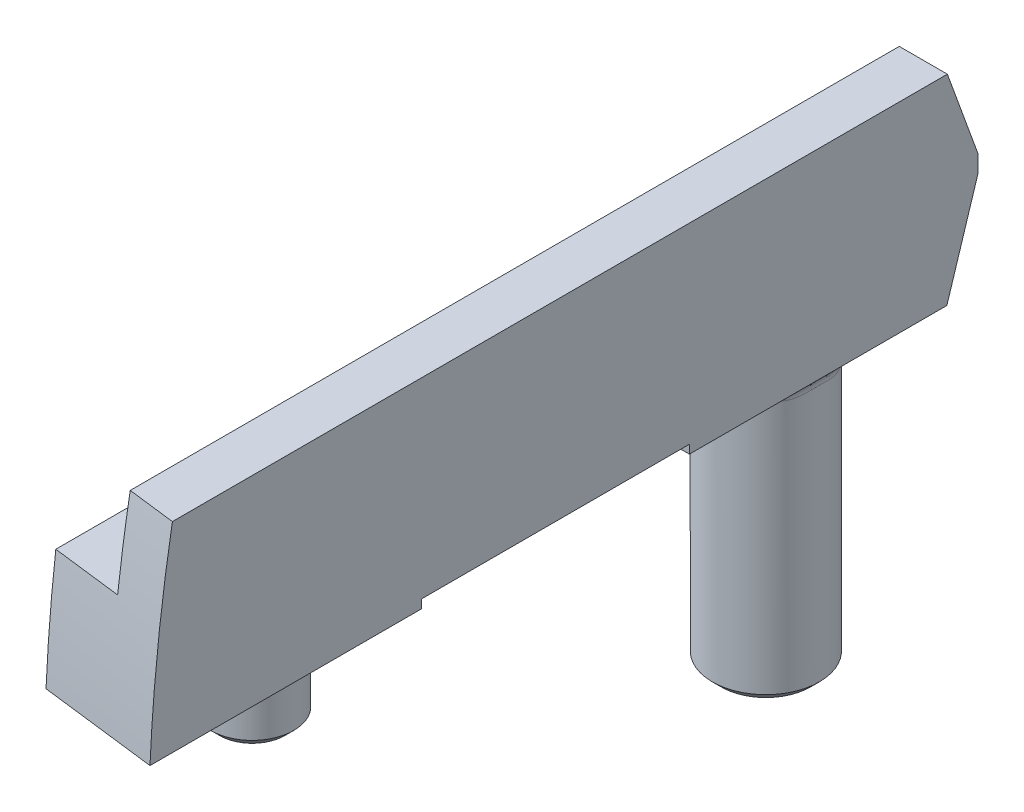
ISO-10303-21;
HEADER;
FILE_DESCRIPTION(('STEP AP214'),'2;1');
FILE_NAME('part.step','',(''),(''),'','','');
FILE_SCHEMA(('AUTOMOTIVE_DESIGN { 1 0 10303 214 1 1 1 1 }'));
ENDSEC;
DATA;
#1=APPLICATION_CONTEXT('core data for automotive mechanical design processes');
#2=APPLICATION_PROTOCOL_DEFINITION('international standard','automotive_design',2000,#1);
#3=PRODUCT_CONTEXT('',#1,'mechanical');
#4=PRODUCT('Part','Part','',(#3));
#5=PRODUCT_RELATED_PRODUCT_CATEGORY('part','',(#4));
#6=PRODUCT_DEFINITION_FORMATION('','',#4);
#7=PRODUCT_DEFINITION_CONTEXT('part definition',#1,'design');
#8=PRODUCT_DEFINITION('design','',#6,#7);
#9=PRODUCT_DEFINITION_SHAPE('','',#8);
#10=(LENGTH_UNIT() NAMED_UNIT(*) SI_UNIT(.MILLI.,.METRE.));
#11=(NAMED_UNIT(*) PLANE_ANGLE_UNIT() SI_UNIT($,.RADIAN.));
#12=(NAMED_UNIT(*) SI_UNIT($,.STERADIAN.) SOLID_ANGLE_UNIT());
#13=UNCERTAINTY_MEASURE_WITH_UNIT(LENGTH_MEASURE(1.E-05),#10,'distance_accuracy_value','');
#14=(GEOMETRIC_REPRESENTATION_CONTEXT(3) GLOBAL_UNCERTAINTY_ASSIGNED_CONTEXT((#13)) GLOBAL_UNIT_ASSIGNED_CONTEXT((#10,
#11,#12)) REPRESENTATION_CONTEXT('',''));
#15=CARTESIAN_POINT('',(0.,0.,0.));
#16=DIRECTION('',(0.,0.,1.));
#17=DIRECTION('',(1.,0.,0.));
#18=AXIS2_PLACEMENT_3D('',#15,#16,#17);
#19=CARTESIAN_POINT('',(0.,0.,24.4856));
#20=DIRECTION('',(1.,0.,0.));
#21=DIRECTION('',(0.,0.,-1.));
#22=AXIS2_PLACEMENT_3D('',#19,#20,#21);
#23=PLANE('',#22);
#24=CARTESIAN_POINT('',(0.,-2.159,-21.9443457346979));
#25=DIRECTION('',(1.,0.,0.));
#26=DIRECTION('',(0.,0.,-1.));
#27=AXIS2_PLACEMENT_3D('',#24,#25,#26);
#28=CIRCLE('',#27,46.0502);
#29=CARTESIAN_POINT('',(0.,3.429,23.765556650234));
#30=VERTEX_POINT('',#29);
#31=CARTESIAN_POINT('',(0.,0.,24.0552155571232));
#32=VERTEX_POINT('',#31);
#33=EDGE_CURVE('E155',#30,#32,#28,.T.);
#34=ORIENTED_EDGE('',*,*,#33,.F.);
#35=DIRECTION('',(0.,0.,-1.));
#36=VECTOR('',#35,1.);
#37=CARTESIAN_POINT('',(0.,3.429,24.4856));
#38=LINE('',#37,#36);
#39=CARTESIAN_POINT('',(0.,3.429,0.));
#40=VERTEX_POINT('',#39);
#41=EDGE_CURVE('E180',#30,#40,#38,.T.);
#42=ORIENTED_EDGE('',*,*,#41,.T.);
#43=DIRECTION('',(0.,-1.,0.));
#44=VECTOR('',#43,1.);
#45=CARTESIAN_POINT('',(0.,0.,0.));
#46=LINE('',#45,#44);
#47=CARTESIAN_POINT('',(0.,2.921,0.));
#48=VERTEX_POINT('',#47);
#49=EDGE_CURVE('E190',#40,#48,#46,.T.);
#50=ORIENTED_EDGE('',*,*,#49,.T.);
#51=DIRECTION('',(0.,-0.953716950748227,0.300705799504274));
#52=VECTOR('',#51,1.);
#53=CARTESIAN_POINT('',(0.,-6.75805315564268,3.05179373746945));
#54=LINE('',#53,#52);
#55=CARTESIAN_POINT('',(0.,0.,0.920987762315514));
#56=VERTEX_POINT('',#55);
#57=EDGE_CURVE('E58',#48,#56,#54,.T.);
#58=ORIENTED_EDGE('',*,*,#57,.T.);
#59=DIRECTION('',(0.,0.,-1.));
#60=VECTOR('',#59,1.);
#61=CARTESIAN_POINT('',(0.,0.,24.4856));
#62=LINE('',#61,#60);
#63=CARTESIAN_POINT('',(0.,0.,3.79883697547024));
#64=VERTEX_POINT('',#63);
#65=EDGE_CURVE('E182',#64,#56,#62,.T.);
#66=ORIENTED_EDGE('',*,*,#65,.F.);
#67=CARTESIAN_POINT('',(0.,0.,5.34516302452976));
#68=VERTEX_POINT('',#67);
#69=EDGE_CURVE('E189',#68,#64,#62,.T.);
#70=ORIENTED_EDGE('',*,*,#69,.F.);
#71=CARTESIAN_POINT('',(0.,0.,8.5344));
#72=VERTEX_POINT('',#71);
#73=EDGE_CURVE('E183',#72,#68,#62,.T.);
#74=ORIENTED_EDGE('',*,*,#73,.F.);
#75=DIRECTION('',(0.,1.,0.));
#76=VECTOR('',#75,1.);
#77=CARTESIAN_POINT('',(0.,0.,8.5344));
#78=LINE('',#77,#76);
#79=CARTESIAN_POINT('',(0.,0.254,8.5344));
#80=VERTEX_POINT('',#79);
#81=EDGE_CURVE('E387',#72,#80,#78,.T.);
#82=ORIENTED_EDGE('',*,*,#81,.T.);
#83=DIRECTION('',(0.,0.,1.));
#84=VECTOR('',#83,1.);
#85=CARTESIAN_POINT('',(0.,0.254,24.4856));
#86=LINE('',#85,#84);
#87=CARTESIAN_POINT('',(0.,0.254,16.4592));
#88=VERTEX_POINT('',#87);
#89=EDGE_CURVE('E385',#80,#88,#86,.T.);
#90=ORIENTED_EDGE('',*,*,#89,.T.);
#91=DIRECTION('',(0.,-1.,0.));
#92=VECTOR('',#91,1.);
#93=CARTESIAN_POINT('',(0.,0.,16.4592));
#94=LINE('',#93,#92);
#95=CARTESIAN_POINT('',(0.,0.,16.4592));
#96=VERTEX_POINT('',#95);
#97=EDGE_CURVE('E384',#88,#96,#94,.T.);
#98=ORIENTED_EDGE('',*,*,#97,.T.);
#99=CARTESIAN_POINT('',(0.,0.,18.7901531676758));
#100=VERTEX_POINT('',#99);
#101=EDGE_CURVE('E186',#100,#96,#62,.T.);
#102=ORIENTED_EDGE('',*,*,#101,.F.);
#103=CARTESIAN_POINT('',(0.,0.,20.0718468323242));
#104=VERTEX_POINT('',#103);
#105=EDGE_CURVE('E179',#104,#100,#62,.T.);
#106=ORIENTED_EDGE('',*,*,#105,.F.);
#107=EDGE_CURVE('E168',#32,#104,#62,.T.);
#108=ORIENTED_EDGE('',*,*,#107,.F.);
#109=EDGE_LOOP('',(#34,#42,#50,#58,#66,#70,#74,#82,#90,#98,#102,#106,#108));
#110=FACE_BOUND('',#109,.T.);
#111=ADVANCED_FACE('F36',(#110),#23,.F.);
#112=CARTESIAN_POINT('',(3.5052,0.,24.4856));
#113=DIRECTION('',(0.,1.,0.));
#114=DIRECTION('',(-1.,0.,0.));
#115=AXIS2_PLACEMENT_3D('',#112,#113,#114);
#116=PLANE('',#115);
#117=ORIENTED_EDGE('',*,*,#73,.T.);
#118=CARTESIAN_POINT('',(1.8034,0.,4.572));
#119=DIRECTION('',(0.,1.,0.));
#120=DIRECTION('',(-1.,0.,0.));
#121=AXIS2_PLACEMENT_3D('',#118,#119,#120);
#122=CIRCLE('',#121,1.96215);
#123=CARTESIAN_POINT('',(3.5052,0.,5.54868284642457));
#124=VERTEX_POINT('',#123);
#125=EDGE_CURVE('E272',#68,#124,#122,.T.);
#126=ORIENTED_EDGE('',*,*,#125,.T.);
#127=DIRECTION('',(0.,0.,-1.));
#128=VECTOR('',#127,1.);
#129=CARTESIAN_POINT('',(3.5052,0.,24.4856));
#130=LINE('',#129,#128);
#131=CARTESIAN_POINT('',(3.5052,0.,8.5344));
#132=VERTEX_POINT('',#131);
#133=EDGE_CURVE('E389',#132,#124,#130,.T.);
#134=ORIENTED_EDGE('',*,*,#133,.F.);
#135=DIRECTION('',(-1.,0.,0.));
#136=VECTOR('',#135,1.);
#137=CARTESIAN_POINT('',(12.2428,0.,8.5344));
#138=LINE('',#137,#136);
#139=EDGE_CURVE('E361',#132,#72,#138,.T.);
#140=ORIENTED_EDGE('',*,*,#139,.T.);
#141=EDGE_LOOP('',(#117,#126,#134,#140));
#142=FACE_BOUND('',#141,.T.);
#143=ADVANCED_FACE('F250',(#142),#116,.F.);
#144=CARTESIAN_POINT('',(3.5052,0.,24.4856));
#145=VERTEX_POINT('',#144);
#146=CARTESIAN_POINT('',(3.5052,0.,16.4592));
#147=VERTEX_POINT('',#146);
#148=EDGE_CURVE('E172',#145,#147,#130,.T.);
#149=ORIENTED_EDGE('',*,*,#148,.F.);
#150=DIRECTION('',(-0.992546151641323,0.,-0.121869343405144));
#151=VECTOR('',#150,1.);
#152=CARTESIAN_POINT('',(3.5052,0.,24.4856));
#153=LINE('',#152,#151);
#154=EDGE_CURVE('E158',#145,#32,#153,.T.);
#155=ORIENTED_EDGE('',*,*,#154,.T.);
#156=ORIENTED_EDGE('',*,*,#107,.T.);
#157=CARTESIAN_POINT('',(1.4732,0.,19.431));
#158=DIRECTION('',(0.,1.,0.));
#159=DIRECTION('',(-1.,0.,0.));
#160=AXIS2_PLACEMENT_3D('',#157,#158,#159);
#161=CIRCLE('',#160,1.60655);
#162=EDGE_CURVE('E415',#104,#100,#161,.T.);
#163=ORIENTED_EDGE('',*,*,#162,.T.);
#164=ORIENTED_EDGE('',*,*,#101,.T.);
#165=DIRECTION('',(-1.,0.,0.));
#166=VECTOR('',#165,1.);
#167=CARTESIAN_POINT('',(12.2428,0.,16.4592));
#168=LINE('',#167,#166);
#169=EDGE_CURVE('E268',#147,#96,#168,.T.);
#170=ORIENTED_EDGE('',*,*,#169,.F.);
#171=EDGE_LOOP('',(#149,#155,#156,#163,#164,#170));
#172=FACE_BOUND('',#171,.T.);
#173=ADVANCED_FACE('F167',(#172),#116,.F.);
#174=ORIENTED_EDGE('',*,*,#65,.T.);
#175=DIRECTION('',(-1.,0.,0.));
#176=VECTOR('',#175,1.);
#177=CARTESIAN_POINT('',(12.2428,0.,0.920987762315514));
#178=LINE('',#177,#176);
#179=CARTESIAN_POINT('',(3.5052,0.,0.920987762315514));
#180=VERTEX_POINT('',#179);
#181=EDGE_CURVE('E623',#180,#56,#178,.T.);
#182=ORIENTED_EDGE('',*,*,#181,.F.);
#183=CARTESIAN_POINT('',(3.5052,0.,3.59531715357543));
#184=VERTEX_POINT('',#183);
#185=EDGE_CURVE('E329',#184,#180,#130,.T.);
#186=ORIENTED_EDGE('',*,*,#185,.F.);
#187=CARTESIAN_POINT('',(1.8034,0.,4.572));
#188=DIRECTION('',(0.,1.,0.));
#189=DIRECTION('',(-1.,0.,0.));
#190=AXIS2_PLACEMENT_3D('',#187,#188,#189);
#191=CIRCLE('',#190,1.96215);
#192=EDGE_CURVE('E210',#184,#64,#191,.T.);
#193=ORIENTED_EDGE('',*,*,#192,.T.);
#194=EDGE_LOOP('',(#174,#182,#186,#193));
#195=FACE_BOUND('',#194,.T.);
#196=ADVANCED_FACE('F518',(#195),#116,.F.);
#197=CARTESIAN_POINT('',(3.5052,5.9182,24.4856));
#198=DIRECTION('',(-1.,0.,0.));
#199=DIRECTION('',(0.,-1.,0.));
#200=AXIS2_PLACEMENT_3D('',#197,#198,#199);
#201=PLANE('',#200);
#202=DIRECTION('',(0.,0.,-1.));
#203=VECTOR('',#202,1.);
#204=CARTESIAN_POINT('',(3.5052,5.9182,24.4856));
#205=LINE('',#204,#203);
#206=CARTESIAN_POINT('',(3.5052,5.91820000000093,23.822334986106));
#207=VERTEX_POINT('',#206);
#208=CARTESIAN_POINT('',(3.5052,5.9182,0.905994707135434));
#209=VERTEX_POINT('',#208);
#210=EDGE_CURVE('E626',#207,#209,#205,.T.);
#211=ORIENTED_EDGE('',*,*,#210,.F.);
#212=CARTESIAN_POINT('',(3.5052,6.91864725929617,23.6326580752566));
#213=CARTESIAN_POINT('',(3.5052,6.69030712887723,23.6785706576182));
#214=CARTESIAN_POINT('',(3.5052,6.46161862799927,23.7227506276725));
#215=CARTESIAN_POINT('',(3.5052,6.00380772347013,23.8075968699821));
#216=CARTESIAN_POINT('',(3.5052,5.77468591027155,23.8482663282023));
#217=CARTESIAN_POINT('',(3.5052,5.31600988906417,23.9261005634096));
#218=CARTESIAN_POINT('',(3.5052,5.08645608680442,23.9632677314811));
#219=CARTESIAN_POINT('',(3.5052,4.62691722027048,24.034104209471));
#220=CARTESIAN_POINT('',(3.5052,4.39693240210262,24.0677751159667));
#221=CARTESIAN_POINT('',(3.5052,3.93653221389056,24.1316234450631));
#222=CARTESIAN_POINT('',(3.5052,3.70611695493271,24.1618016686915));
#223=CARTESIAN_POINT('',(3.5052,3.24485600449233,24.2186666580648));
#224=CARTESIAN_POINT('',(3.5052,3.01401031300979,24.2453534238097));
#225=CARTESIAN_POINT('',(3.5052,2.55188829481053,24.2952351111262));
#226=CARTESIAN_POINT('',(3.5052,2.3206118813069,24.3184292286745));
#227=CARTESIAN_POINT('',(3.5052,1.8576281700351,24.3613228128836));
#228=CARTESIAN_POINT('',(3.5052,1.6259207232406,24.381020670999));
#229=CARTESIAN_POINT('',(3.5052,1.16207446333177,24.4169164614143));
#230=CARTESIAN_POINT('',(3.5052,0.929935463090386,24.4331119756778));
#231=CARTESIAN_POINT('',(3.5052,0.465225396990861,24.4619955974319));
#232=CARTESIAN_POINT('',(3.5052,0.232654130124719,24.4746804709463));
#233=CARTESIAN_POINT('',(3.5052,0.,24.4856));
#234=B_SPLINE_CURVE_WITH_KNOTS('',3,(#212,#213,#214,#215,#216,#217,#218,#219,#220,#221,#222,
#223,#224,#225,#226,#227,#228,#229,#230,#231,#232,#233),.UNSPECIFIED.,.F.,.F.,(4,2,2,2,2,2,2,2,
2,2,4),(0.,0.698724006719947,1.39680706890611,2.09441002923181,2.79169301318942,
3.48881576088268,4.18593850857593,4.88322149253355,5.58082445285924,6.2789075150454,
6.97763152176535),.UNSPECIFIED.);
#235=EDGE_CURVE('E163',#207,#145,#234,.T.);
#236=ORIENTED_EDGE('',*,*,#235,.T.);
#237=ORIENTED_EDGE('',*,*,#148,.T.);
#238=DIRECTION('',(0.,1.,0.));
#239=VECTOR('',#238,1.);
#240=CARTESIAN_POINT('',(3.5052,5.9182,16.4592));
#241=LINE('',#240,#239);
#242=CARTESIAN_POINT('',(3.5052,0.254,16.4592));
#243=VERTEX_POINT('',#242);
#244=EDGE_CURVE('E363',#147,#243,#241,.T.);
#245=ORIENTED_EDGE('',*,*,#244,.T.);
#246=DIRECTION('',(0.,0.,-1.));
#247=VECTOR('',#246,1.);
#248=CARTESIAN_POINT('',(3.5052,0.254,24.4856));
#249=LINE('',#248,#247);
#250=CARTESIAN_POINT('',(3.5052,0.254,8.5344));
#251=VERTEX_POINT('',#250);
#252=EDGE_CURVE('E340',#243,#251,#249,.T.);
#253=ORIENTED_EDGE('',*,*,#252,.T.);
#254=DIRECTION('',(0.,-1.,0.));
#255=VECTOR('',#254,1.);
#256=CARTESIAN_POINT('',(3.5052,5.9182,8.5344));
#257=LINE('',#256,#255);
#258=EDGE_CURVE('E335',#251,#132,#257,.T.);
#259=ORIENTED_EDGE('',*,*,#258,.T.);
#260=ORIENTED_EDGE('',*,*,#133,.T.);
#261=EDGE_CURVE('E625',#124,#184,#130,.T.);
#262=ORIENTED_EDGE('',*,*,#261,.T.);
#263=ORIENTED_EDGE('',*,*,#185,.T.);
#264=DIRECTION('',(0.,0.953716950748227,-0.300705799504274));
#265=VECTOR('',#264,1.);
#266=CARTESIAN_POINT('',(3.5052,-1.37500034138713,1.35452370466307));
#267=LINE('',#266,#265);
#268=CARTESIAN_POINT('',(3.5052,2.921,0.));
#269=VERTEX_POINT('',#268);
#270=EDGE_CURVE('E315',#180,#269,#267,.T.);
#271=ORIENTED_EDGE('',*,*,#270,.T.);
#272=DIRECTION('',(0.,1.,0.));
#273=VECTOR('',#272,1.);
#274=CARTESIAN_POINT('',(3.5052,5.9182,0.));
#275=LINE('',#274,#273);
#276=CARTESIAN_POINT('',(3.5052,3.429,0.));
#277=VERTEX_POINT('',#276);
#278=EDGE_CURVE('E326',#269,#277,#275,.T.);
#279=ORIENTED_EDGE('',*,*,#278,.T.);
#280=DIRECTION('',(0.,0.939692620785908,0.34202014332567));
#281=VECTOR('',#280,1.);
#282=CARTESIAN_POINT('',(3.5052,13.4965390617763,3.66428455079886));
#283=LINE('',#282,#281);
#284=EDGE_CURVE('E174',#277,#209,#283,.T.);
#285=ORIENTED_EDGE('',*,*,#284,.T.);
#286=EDGE_LOOP('',(#211,#236,#237,#245,#253,#259,#260,#262,#263,#271,#279,#285));
#287=FACE_BOUND('',#286,.T.);
#288=ADVANCED_FACE('F324',(#287),#201,.F.);
#289=CARTESIAN_POINT('',(2.0828,5.9182,24.4856));
#290=DIRECTION('',(0.,-1.,0.));
#291=DIRECTION('',(1.,0.,0.));
#292=AXIS2_PLACEMENT_3D('',#289,#290,#291);
#293=PLANE('',#292);
#294=DIRECTION('',(0.,0.,-1.));
#295=VECTOR('',#294,1.);
#296=CARTESIAN_POINT('',(2.0828,5.9182,24.4856));
#297=LINE('',#296,#295);
#298=CARTESIAN_POINT('',(2.0828,5.91819999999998,23.647686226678));
#299=VERTEX_POINT('',#298);
#300=CARTESIAN_POINT('',(2.0828,5.9182,0.905994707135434));
#301=VERTEX_POINT('',#300);
#302=EDGE_CURVE('E347',#299,#301,#297,.T.);
#303=ORIENTED_EDGE('',*,*,#302,.F.);
#304=DIRECTION('',(-0.992546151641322,0.,-0.121869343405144));
#305=VECTOR('',#304,1.);
#306=CARTESIAN_POINT('',(1.7526,5.9182,23.6071427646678));
#307=LINE('',#306,#305);
#308=EDGE_CURVE('E618',#299,#207,#307,.F.);
#309=ORIENTED_EDGE('',*,*,#308,.T.);
#310=ORIENTED_EDGE('',*,*,#210,.T.);
#311=DIRECTION('',(-1.,0.,0.));
#312=VECTOR('',#311,1.);
#313=CARTESIAN_POINT('',(12.2428,5.9182,0.905994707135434));
#314=LINE('',#313,#312);
#315=EDGE_CURVE('E330',#209,#301,#314,.T.);
#316=ORIENTED_EDGE('',*,*,#315,.T.);
#317=EDGE_LOOP('',(#303,#309,#310,#316));
#318=FACE_BOUND('',#317,.T.);
#319=ADVANCED_FACE('F573',(#318),#293,.F.);
#320=CARTESIAN_POINT('',(2.0828,3.429,24.4856));
#321=DIRECTION('',(1.,0.,0.));
#322=DIRECTION('',(0.,0.,-1.));
#323=AXIS2_PLACEMENT_3D('',#320,#321,#322);
#324=PLANE('',#323);
#325=DIRECTION('',(0.,0.,-1.));
#326=VECTOR('',#325,1.);
#327=CARTESIAN_POINT('',(2.0828,3.429,24.4856));
#328=LINE('',#327,#326);
#329=CARTESIAN_POINT('',(2.0828,3.429,24.0212923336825));
#330=VERTEX_POINT('',#329);
#331=CARTESIAN_POINT('',(2.0828,3.429,0.));
#332=VERTEX_POINT('',#331);
#333=EDGE_CURVE('E184',#330,#332,#328,.T.);
#334=ORIENTED_EDGE('',*,*,#333,.F.);
#335=CARTESIAN_POINT('',(2.0828,3.429,24.0212923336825));
#336=CARTESIAN_POINT('',(2.0828,3.84556874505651,23.9703649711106));
#337=CARTESIAN_POINT('',(2.0828,4.2612864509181,23.9137674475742));
#338=CARTESIAN_POINT('',(2.0828,5.09101978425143,23.7892320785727));
#339=CARTESIAN_POINT('',(2.0828,5.50503541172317,23.7212942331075));
#340=CARTESIAN_POINT('',(2.0828,5.91819999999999,23.6476862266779));
#341=B_SPLINE_CURVE_WITH_KNOTS('',3,(#335,#336,#337,#338,#339,#340),.UNSPECIFIED.,.F.,.F.,(4,2,
4),(0.,1.25865818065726,2.51731636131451),.UNSPECIFIED.);
#342=EDGE_CURVE('E51',#330,#299,#341,.T.);
#343=ORIENTED_EDGE('',*,*,#342,.T.);
#344=ORIENTED_EDGE('',*,*,#302,.T.);
#345=DIRECTION('',(0.,-0.939692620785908,-0.34202014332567));
#346=VECTOR('',#345,1.);
#347=CARTESIAN_POINT('',(2.0828,11.2985201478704,2.86427109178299));
#348=LINE('',#347,#346);
#349=EDGE_CURVE('E353',#301,#332,#348,.T.);
#350=ORIENTED_EDGE('',*,*,#349,.T.);
#351=EDGE_LOOP('',(#334,#343,#344,#350));
#352=FACE_BOUND('',#351,.T.);
#353=ADVANCED_FACE('F355',(#352),#324,.F.);
#354=CARTESIAN_POINT('',(0.,3.429,24.4856));
#355=DIRECTION('',(0.,-1.,0.));
#356=DIRECTION('',(0.,0.,-1.));
#357=AXIS2_PLACEMENT_3D('',#354,#355,#356);
#358=PLANE('',#357);
#359=ORIENTED_EDGE('',*,*,#41,.F.);
#360=DIRECTION('',(-0.992546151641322,0.,-0.121869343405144));
#361=VECTOR('',#360,1.);
#362=CARTESIAN_POINT('',(1.7526,3.429,23.9807488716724));
#363=LINE('',#362,#361);
#364=EDGE_CURVE('E11',#30,#330,#363,.F.);
#365=ORIENTED_EDGE('',*,*,#364,.T.);
#366=ORIENTED_EDGE('',*,*,#333,.T.);
#367=DIRECTION('',(-1.,0.,0.));
#368=VECTOR('',#367,1.);
#369=CARTESIAN_POINT('',(0.,3.429,0.));
#370=LINE('',#369,#368);
#371=EDGE_CURVE('E334',#332,#40,#370,.T.);
#372=ORIENTED_EDGE('',*,*,#371,.T.);
#373=EDGE_LOOP('',(#359,#365,#366,#372));
#374=FACE_BOUND('',#373,.T.);
#375=ADVANCED_FACE('F253',(#374),#358,.F.);
#376=CARTESIAN_POINT('',(0.,0.,0.));
#377=DIRECTION('',(0.,0.,-1.));
#378=DIRECTION('',(-1.,0.,0.));
#379=AXIS2_PLACEMENT_3D('',#376,#377,#378);
#380=PLANE('',#379);
#381=DIRECTION('',(1.,0.,0.));
#382=VECTOR('',#381,1.);
#383=CARTESIAN_POINT('',(0.,2.921,0.));
#384=LINE('',#383,#382);
#385=EDGE_CURVE('E44',#48,#269,#384,.T.);
#386=ORIENTED_EDGE('',*,*,#385,.F.);
#387=ORIENTED_EDGE('',*,*,#49,.F.);
#388=ORIENTED_EDGE('',*,*,#371,.F.);
#389=DIRECTION('',(-1.,0.,0.));
#390=VECTOR('',#389,1.);
#391=CARTESIAN_POINT('',(0.,3.429,0.));
#392=LINE('',#391,#390);
#393=EDGE_CURVE('E274',#277,#332,#392,.T.);
#394=ORIENTED_EDGE('',*,*,#393,.F.);
#395=ORIENTED_EDGE('',*,*,#278,.F.);
#396=EDGE_LOOP('',(#386,#387,#388,#394,#395));
#397=FACE_BOUND('',#396,.T.);
#398=ADVANCED_FACE('F251',(#397),#380,.T.);
#399=CARTESIAN_POINT('',(12.2428,0.,8.5344));
#400=DIRECTION('',(0.,0.,-1.));
#401=DIRECTION('',(-1.,0.,0.));
#402=AXIS2_PLACEMENT_3D('',#399,#400,#401);
#403=PLANE('',#402);
#404=DIRECTION('',(-1.,0.,0.));
#405=VECTOR('',#404,1.);
#406=CARTESIAN_POINT('',(12.2428,0.254,8.5344));
#407=LINE('',#406,#405);
#408=EDGE_CURVE('E364',#251,#80,#407,.T.);
#409=ORIENTED_EDGE('',*,*,#408,.T.);
#410=ORIENTED_EDGE('',*,*,#81,.F.);
#411=ORIENTED_EDGE('',*,*,#139,.F.);
#412=ORIENTED_EDGE('',*,*,#258,.F.);
#413=EDGE_LOOP('',(#409,#410,#411,#412));
#414=FACE_BOUND('',#413,.T.);
#415=ADVANCED_FACE('F534',(#414),#403,.F.);
#416=CARTESIAN_POINT('',(12.2428,0.254,8.5344));
#417=DIRECTION('',(0.,1.,0.));
#418=DIRECTION('',(0.,0.,1.));
#419=AXIS2_PLACEMENT_3D('',#416,#417,#418);
#420=PLANE('',#419);
#421=DIRECTION('',(-1.,0.,0.));
#422=VECTOR('',#421,1.);
#423=CARTESIAN_POINT('',(12.2428,0.254,16.4592));
#424=LINE('',#423,#422);
#425=EDGE_CURVE('E367',#243,#88,#424,.T.);
#426=ORIENTED_EDGE('',*,*,#425,.T.);
#427=ORIENTED_EDGE('',*,*,#89,.F.);
#428=ORIENTED_EDGE('',*,*,#408,.F.);
#429=ORIENTED_EDGE('',*,*,#252,.F.);
#430=EDGE_LOOP('',(#426,#427,#428,#429));
#431=FACE_BOUND('',#430,.T.);
#432=ADVANCED_FACE('F379',(#431),#420,.F.);
#433=CARTESIAN_POINT('',(12.2428,0.254,16.4592));
#434=DIRECTION('',(0.,0.,1.));
#435=DIRECTION('',(1.,0.,0.));
#436=AXIS2_PLACEMENT_3D('',#433,#434,#435);
#437=PLANE('',#436);
#438=ORIENTED_EDGE('',*,*,#169,.T.);
#439=ORIENTED_EDGE('',*,*,#97,.F.);
#440=ORIENTED_EDGE('',*,*,#425,.F.);
#441=ORIENTED_EDGE('',*,*,#244,.F.);
#442=EDGE_LOOP('',(#438,#439,#440,#441));
#443=FACE_BOUND('',#442,.T.);
#444=ADVANCED_FACE('F382',(#443),#437,.F.);
#445=CARTESIAN_POINT('',(1.8034,-8.128,4.572));
#446=DIRECTION('',(0.,1.,0.));
#447=DIRECTION('',(-1.,0.,0.));
#448=AXIS2_PLACEMENT_3D('',#445,#446,#447);
#449=CYLINDRICAL_SURFACE('',#448,1.58115);
#450=CARTESIAN_POINT('',(1.8034,-0.380999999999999,4.572));
#451=DIRECTION('',(0.,1.,0.));
#452=DIRECTION('',(-1.,0.,0.));
#453=AXIS2_PLACEMENT_3D('',#450,#451,#452);
#454=CIRCLE('',#453,1.58115);
#455=CARTESIAN_POINT('',(3.17475339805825,-0.381,5.35903569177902));
#456=VERTEX_POINT('',#455);
#457=CARTESIAN_POINT('',(0.350174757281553,-0.380999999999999,5.19503428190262));
#458=VERTEX_POINT('',#457);
#459=EDGE_CURVE('E634',#456,#458,#454,.F.);
#460=ORIENTED_EDGE('',*,*,#459,.T.);
#461=CARTESIAN_POINT('',(0.485669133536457,-0.341889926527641,5.44585392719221));
#462=CARTESIAN_POINT('',(0.404431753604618,0.198902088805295,5.32335175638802));
#463=CARTESIAN_POINT('',(0.,0.,5.65642113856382));
#464=CARTESIAN_POINT('',(0.473872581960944,-0.349068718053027,5.42807390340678));
#465=CARTESIAN_POINT('',(0.406640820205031,0.178880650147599,5.32321057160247));
#466=CARTESIAN_POINT('',(0.,0.,5.6343567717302));
#467=CARTESIAN_POINT('',(0.462311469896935,-0.354981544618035,5.40985016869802));
#468=CARTESIAN_POINT('',(0.406379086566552,0.159315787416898,5.31997305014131));
#469=CARTESIAN_POINT('',(0.,0.,5.61174177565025));
#470=CARTESIAN_POINT('',(0.439820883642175,-0.364699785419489,5.37272062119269));
#471=CARTESIAN_POINT('',(0.402321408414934,0.122770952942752,5.30847350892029));
#472=CARTESIAN_POINT('',(0.,0.,5.56566534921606));
#473=CARTESIAN_POINT('',(0.428889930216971,-0.368510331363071,5.35381659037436));
#474=CARTESIAN_POINT('',(0.398666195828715,0.105645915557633,5.30040545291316));
#475=CARTESIAN_POINT('',(0.,0.,5.54220613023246));
#476=CARTESIAN_POINT('',(0.397371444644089,-0.377414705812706,5.29657318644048));
#477=CARTESIAN_POINT('',(0.384935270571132,0.0596171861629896,5.27120052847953));
#478=CARTESIAN_POINT('',(0.,0.,5.47116913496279));
#479=CARTESIAN_POINT('',(0.377859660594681,-0.38008491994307,5.25740417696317));
#480=CARTESIAN_POINT('',(0.37193086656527,0.0333213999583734,5.2445833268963));
#481=CARTESIAN_POINT('',(0.,0.,5.42256180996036));
#482=CARTESIAN_POINT('',(0.327010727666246,-0.382134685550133,5.14370656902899));
#483=CARTESIAN_POINT('',(0.3339106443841,-0.0259479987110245,5.15838758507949));
#484=CARTESIAN_POINT('',(0.,0.,5.28146718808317));
#485=CARTESIAN_POINT('',(0.2996909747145,-0.376798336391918,5.06738053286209));
#486=CARTESIAN_POINT('',(0.306120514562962,-0.0514829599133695,5.08692385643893));
#487=CARTESIAN_POINT('',(0.,0.,5.1867493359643));
#488=CARTESIAN_POINT('',(0.25695966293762,-0.364041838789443,4.91132322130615));
#489=CARTESIAN_POINT('',(0.261933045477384,-0.0840141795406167,4.93322582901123));
#490=CARTESIAN_POINT('',(0.,0.,4.99308785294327));
#491=CARTESIAN_POINT('',(0.241598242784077,-0.356613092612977,4.8315790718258));
#492=CARTESIAN_POINT('',(0.244256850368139,-0.0924685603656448,4.84910813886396));
#493=CARTESIAN_POINT('',(0.,0.,4.8941282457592));
#494=CARTESIAN_POINT('',(0.227566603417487,-0.349350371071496,4.7084593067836));
#495=CARTESIAN_POINT('',(0.228332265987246,-0.0994879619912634,4.71818961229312));
#496=CARTESIAN_POINT('',(0.,0.,4.74134106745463));
#497=CARTESIAN_POINT('',(0.224442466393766,-0.347587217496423,4.6656473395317));
#498=CARTESIAN_POINT('',(0.224748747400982,-0.100889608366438,4.67230117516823));
#499=CARTESIAN_POINT('',(0.,0.,4.68821296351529));
#500=CARTESIAN_POINT('',(0.221687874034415,-0.346039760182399,4.57988390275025));
#501=CARTESIAN_POINT('',(0.221616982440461,-0.102122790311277,4.58054792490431));
#502=CARTESIAN_POINT('',(0.,0.,4.58178363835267));
#503=CARTESIAN_POINT('',(0.222057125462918,-0.346255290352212,4.53693244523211));
#504=CARTESIAN_POINT('',(0.222040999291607,-0.101965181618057,4.53428488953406));
#505=CARTESIAN_POINT('',(0.,0.,4.52848243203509));
#506=CARTESIAN_POINT('',(0.226285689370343,-0.34861390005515,4.45121666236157));
#507=CARTESIAN_POINT('',(0.22685324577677,-0.100052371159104,4.44270463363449));
#508=CARTESIAN_POINT('',(0.,0.,4.42211224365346));
#509=CARTESIAN_POINT('',(0.230146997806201,-0.350758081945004,4.40845245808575));
#510=CARTESIAN_POINT('',(0.231285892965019,-0.0982793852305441,4.39699178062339));
#511=CARTESIAN_POINT('',(0.,0.,4.36904341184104));
#512=CARTESIAN_POINT('',(0.241321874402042,-0.356327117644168,4.3234310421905));
#513=CARTESIAN_POINT('',(0.243793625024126,-0.0924811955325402,4.30746215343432));
#514=CARTESIAN_POINT('',(0.,0.,4.26353490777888));
#515=CARTESIAN_POINT('',(0.248636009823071,-0.359752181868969,4.28117391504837));
#516=CARTESIAN_POINT('',(0.251977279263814,-0.0883974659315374,4.26327492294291));
#517=CARTESIAN_POINT('',(0.,0.,4.21109534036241));
#518=CARTESIAN_POINT('',(0.266473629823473,-0.36674703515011,4.19830155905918));
#519=CARTESIAN_POINT('',(0.271194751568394,-0.0769387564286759,4.17874710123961));
#520=CARTESIAN_POINT('',(0.,0.,4.10825374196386));
#521=CARTESIAN_POINT('',(0.276925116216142,-0.370312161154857,4.15767054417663));
#522=CARTESIAN_POINT('',(0.282322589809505,-0.0695051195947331,4.13801968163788));
#523=CARTESIAN_POINT('',(0.,0.,4.05783212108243));
#524=CARTESIAN_POINT('',(0.301026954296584,-0.376396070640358,4.07736217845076));
#525=CARTESIAN_POINT('',(0.306565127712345,-0.0498795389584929,4.06062910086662));
#526=CARTESIAN_POINT('',(0.,0.,3.9581723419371));
#527=CARTESIAN_POINT('',(0.314673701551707,-0.378916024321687,4.03768380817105));
#528=CARTESIAN_POINT('',(0.319857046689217,-0.0374407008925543,4.02374191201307));
#529=CARTESIAN_POINT('',(0.,0.,3.90893291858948));
#530=CARTESIAN_POINT('',(0.345129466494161,-0.381420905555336,3.95942868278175));
#531=CARTESIAN_POINT('',(0.346774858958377,-0.00594020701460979,3.95585191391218));
#532=CARTESIAN_POINT('',(0.,0.,3.81182113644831));
#533=CARTESIAN_POINT('',(0.361941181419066,-0.381403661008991,3.9208528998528));
#534=CARTESIAN_POINT('',(0.360547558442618,0.0135875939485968,3.92479655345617));
#535=CARTESIAN_POINT('',(0.,0.,3.76394998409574));
#536=CARTESIAN_POINT('',(0.389409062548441,-0.378048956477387,3.86410921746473));
#537=CARTESIAN_POINT('',(0.378708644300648,0.0487141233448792,3.88565600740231));
#538=CARTESIAN_POINT('',(0.,0.,3.69353312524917));
#539=CARTESIAN_POINT('',(0.39896260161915,-0.376368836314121,3.84534295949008));
#540=CARTESIAN_POINT('',(0.384475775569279,0.0618178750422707,3.87360300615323));
#541=CARTESIAN_POINT('',(0.,0.,3.67024487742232));
#542=CARTESIAN_POINT('',(0.418767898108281,-0.371578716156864,3.80827701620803));
#543=CARTESIAN_POINT('',(0.394502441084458,0.0903262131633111,3.85249891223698));
#544=CARTESIAN_POINT('',(0.,0.,3.62424738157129));
#545=CARTESIAN_POINT('',(0.429020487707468,-0.368466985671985,3.78997792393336));
#546=CARTESIAN_POINT('',(0.398721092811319,0.105846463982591,3.84352783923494));
#547=CARTESIAN_POINT('',(0.,0.,3.60153886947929));
#548=CARTESIAN_POINT('',(0.439588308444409,-0.364484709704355,3.77196688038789));
#549=CARTESIAN_POINT('',(0.401651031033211,0.122273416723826,3.83663833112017));
#550=CARTESIAN_POINT('',(0.,0.,3.57918781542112));
#551=(BOUNDED_SURFACE() B_SPLINE_SURFACE(3,2,((#461,#462,#463),(#464,#465,#466),(#467,#468,
#469),(#470,#471,#472),(#473,#474,#475),(#476,#477,#478),(#479,#480,#481),(#482,#483,#484),
(#485,#486,#487),(#488,#489,#490),(#491,#492,#493),(#494,#495,#496),(#497,#498,#499),(#500,#501,
#502),(#503,#504,#505),(#506,#507,#508),(#509,#510,#511),(#512,#513,#514),(#515,#516,#517),
(#518,#519,#520),(#521,#522,#523),(#524,#525,#526),(#527,#528,#529),(#530,#531,#532),(#533,#534,
#535),(#536,#537,#538),(#539,#540,#541),(#542,#543,#544),(#545,#546,#547),(#548,#549,#550)),
.UNSPECIFIED.,.F.,.F.,.F.) B_SPLINE_SURFACE_WITH_KNOTS((4,2,2,2,2,2,2,2,2,2,2,2,2,2,4),(3,3),
(0.,0.0822030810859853,0.164204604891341,0.326853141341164,0.62753696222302,0.929474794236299,
1.08917882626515,1.24886945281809,1.4086514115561,1.56845962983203,1.72484937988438,
1.8810635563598,2.03741146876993,2.11591705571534,2.19451778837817),(0.,1.),
.UNSPECIFIED.) GEOMETRIC_REPRESENTATION_ITEM() RATIONAL_B_SPLINE_SURFACE(((1.,0.562228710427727,
1.),(1.,0.57500247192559,1.),(1.,0.587470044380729,1.),(1.,0.611646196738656,1.),(1.,
0.623356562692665,1.),(1.,0.657038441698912,1.),(1.,0.677774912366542,1.),(1.,0.731661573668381,
1.),(1.,0.760411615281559,1.),(1.,0.805297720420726,1.),(1.,0.82138067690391,1.),(1.,
0.836064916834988,1.),(1.,0.839332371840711,1.),(1.,0.84221341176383,1.),(1.,0.841827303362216,
1.),(1.,0.837404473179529,1.),(1.,0.833365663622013,1.),(1.,0.821667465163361,1.),(1.,
0.814007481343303,1.),(1.,0.79530203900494,1.),(1.,0.784332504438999,1.),(1.,0.758988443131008,
1.),(1.,0.744617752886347,1.),(1.,0.712459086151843,1.),(1.,0.694668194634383,1.),(1.,
0.665483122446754,1.),(1.,0.6553142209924,1.),(1.,0.634181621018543,1.),(1.,0.623216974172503,
1.),(1.,0.611882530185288,1.))) REPRESENTATION_ITEM('') SURFACE());
#552=CARTESIAN_POINT('',(0.485669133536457,-0.341889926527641,5.44585392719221));
#553=CARTESIAN_POINT('',(0.473872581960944,-0.349068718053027,5.42807390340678));
#554=CARTESIAN_POINT('',(0.462311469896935,-0.354981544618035,5.40985016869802));
#555=CARTESIAN_POINT('',(0.439820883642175,-0.364699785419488,5.37272062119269));
#556=CARTESIAN_POINT('',(0.428889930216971,-0.368510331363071,5.35381659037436));
#557=CARTESIAN_POINT('',(0.397371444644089,-0.377414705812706,5.29657318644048));
#558=CARTESIAN_POINT('',(0.377859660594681,-0.38008491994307,5.25740417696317));
#559=CARTESIAN_POINT('',(0.327010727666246,-0.382134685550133,5.14370656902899));
#560=CARTESIAN_POINT('',(0.2996909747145,-0.376798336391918,5.06738053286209));
#561=CARTESIAN_POINT('',(0.25695966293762,-0.364041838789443,4.91132322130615));
#562=CARTESIAN_POINT('',(0.241598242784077,-0.356613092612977,4.8315790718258));
#563=CARTESIAN_POINT('',(0.227566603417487,-0.349350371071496,4.7084593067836));
#564=CARTESIAN_POINT('',(0.224442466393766,-0.347587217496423,4.6656473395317));
#565=CARTESIAN_POINT('',(0.221687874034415,-0.346039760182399,4.57988390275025));
#566=CARTESIAN_POINT('',(0.222057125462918,-0.346255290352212,4.53693244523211));
#567=CARTESIAN_POINT('',(0.226285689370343,-0.34861390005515,4.45121666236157));
#568=CARTESIAN_POINT('',(0.230146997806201,-0.350758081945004,4.40845245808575));
#569=CARTESIAN_POINT('',(0.241321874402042,-0.356327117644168,4.3234310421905));
#570=CARTESIAN_POINT('',(0.248636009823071,-0.359752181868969,4.28117391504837));
#571=CARTESIAN_POINT('',(0.266473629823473,-0.36674703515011,4.19830155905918));
#572=CARTESIAN_POINT('',(0.276925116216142,-0.370312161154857,4.15767054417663));
#573=CARTESIAN_POINT('',(0.301026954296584,-0.376396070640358,4.07736217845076));
#574=CARTESIAN_POINT('',(0.314673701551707,-0.378916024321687,4.03768380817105));
#575=CARTESIAN_POINT('',(0.345129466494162,-0.381420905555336,3.95942868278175));
#576=CARTESIAN_POINT('',(0.361941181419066,-0.381403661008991,3.9208528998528));
#577=CARTESIAN_POINT('',(0.389409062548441,-0.378048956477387,3.86410921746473));
#578=CARTESIAN_POINT('',(0.39896260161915,-0.376368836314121,3.84534295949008));
#579=CARTESIAN_POINT('',(0.418767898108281,-0.371578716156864,3.80827701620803));
#580=CARTESIAN_POINT('',(0.429020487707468,-0.368466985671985,3.78997792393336));
#581=CARTESIAN_POINT('',(0.439588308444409,-0.364484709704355,3.77196688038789));
#582=B_SPLINE_CURVE_WITH_KNOTS('',3,(#552,#553,#554,#555,#556,#557,#558,#559,#560,#561,#562,
#563,#564,#565,#566,#567,#568,#569,#570,#571,#572,#573,#574,#575,#576,#577,#578,#579,#580,#581),
.UNSPECIFIED.,.F.,.F.,(4,2,2,2,2,2,2,2,2,2,2,2,2,2,4),(0.,0.0822030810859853,0.164204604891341,
0.326853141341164,0.62753696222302,0.929474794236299,1.08917882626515,1.24886945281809,
1.4086514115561,1.56845962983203,1.72484937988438,1.8810635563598,2.03741146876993,
2.11591705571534,2.19451778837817),.UNSPECIFIED.);
#583=CARTESIAN_POINT('',(0.350174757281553,-0.380999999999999,3.94896571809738));
#584=VERTEX_POINT('',#583);
#585=EDGE_CURVE('E276',#458,#584,#582,.T.);
#586=ORIENTED_EDGE('',*,*,#585,.T.);
#587=CARTESIAN_POINT('',(1.8034,-0.380999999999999,4.572));
#588=DIRECTION('',(0.,1.,0.));
#589=DIRECTION('',(-1.,0.,0.));
#590=AXIS2_PLACEMENT_3D('',#587,#588,#589);
#591=CIRCLE('',#590,1.58115);
#592=CARTESIAN_POINT('',(3.17475339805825,-0.381,3.78496430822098));
#593=VERTEX_POINT('',#592);
#594=EDGE_CURVE('E211',#584,#593,#591,.F.);
#595=ORIENTED_EDGE('',*,*,#594,.T.);
#596=CARTESIAN_POINT('',(3.05177971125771,-0.34910233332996,3.60164778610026));
#597=CARTESIAN_POINT('',(3.13583823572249,0.161462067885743,3.70979094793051));
#598=CARTESIAN_POINT('',(3.5052,0.,3.36782797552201));
#599=CARTESIAN_POINT('',(3.06349120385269,-0.355442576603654,3.61670867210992));
#600=CARTESIAN_POINT('',(3.13363834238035,0.144407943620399,3.70958457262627));
#601=CARTESIAN_POINT('',(3.5052,0.,3.38651799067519));
#602=CARTESIAN_POINT('',(3.07505610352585,-0.360650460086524,3.63215599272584));
#603=CARTESIAN_POINT('',(3.13360368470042,0.127497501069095,3.71165206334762));
#604=CARTESIAN_POINT('',(3.5052,0.,3.40568755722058));
#605=CARTESIAN_POINT('',(3.09774279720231,-0.369114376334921,3.66365815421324));
#606=CARTESIAN_POINT('',(3.13685880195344,0.0954138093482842,3.71969289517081));
#607=CARTESIAN_POINT('',(3.5052,0.,3.44478060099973));
#608=CARTESIAN_POINT('',(3.10886554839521,-0.372374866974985,3.67971151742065));
#609=CARTESIAN_POINT('',(3.14002631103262,0.0801591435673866,3.72552477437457));
#610=CARTESIAN_POINT('',(3.5052,0.,3.46470224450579));
#611=CARTESIAN_POINT('',(3.14114921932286,-0.379674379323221,3.72822350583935));
#612=CARTESIAN_POINT('',(3.15250262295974,0.0386491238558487,3.74718593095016));
#613=CARTESIAN_POINT('',(3.5052,0.,3.52490386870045));
#614=CARTESIAN_POINT('',(3.1615303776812,-0.381376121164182,3.76142495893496));
#615=CARTESIAN_POINT('',(3.16483143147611,0.0143308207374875,3.76741348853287));
#616=CARTESIAN_POINT('',(3.5052,0.,3.56610567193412));
#617=CARTESIAN_POINT('',(3.21483321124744,-0.380131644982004,3.85594483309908));
#618=CARTESIAN_POINT('',(3.20229572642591,-0.0404704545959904,3.83348863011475));
#619=CARTESIAN_POINT('',(3.5052,0.,3.68340141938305));
#620=CARTESIAN_POINT('',(3.24494720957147,-0.372453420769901,3.91876106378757));
#621=CARTESIAN_POINT('',(3.23107159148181,-0.0651200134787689,3.88844951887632));
#622=CARTESIAN_POINT('',(3.5052,0.,3.76135409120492));
#623=CARTESIAN_POINT('',(3.29671647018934,-0.351273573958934,4.04764922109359));
#624=CARTESIAN_POINT('',(3.28328086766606,-0.0967452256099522,4.01016478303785));
#625=CARTESIAN_POINT('',(3.5052,0.,3.92129963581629));
#626=CARTESIAN_POINT('',(3.31828867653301,-0.3377173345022,4.11374640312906));
#627=CARTESIAN_POINT('',(3.30756530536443,-0.104995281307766,4.07762857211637));
#628=CARTESIAN_POINT('',(3.5052,0.,4.00332384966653));
#629=CARTESIAN_POINT('',(3.35317605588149,-0.311138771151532,4.25052616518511));
#630=CARTESIAN_POINT('',(3.34699742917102,-0.113454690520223,4.22045759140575));
#631=CARTESIAN_POINT('',(3.5052,0.,4.17306259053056));
#632=CARTESIAN_POINT('',(3.3662108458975,-0.29814655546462,4.32128755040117));
#633=CARTESIAN_POINT('',(3.36267257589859,-0.11383443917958,4.29734745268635));
#634=CARTESIAN_POINT('',(3.5052,0.,4.26087491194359));
#635=CARTESIAN_POINT('',(3.37843524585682,-0.285158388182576,4.42853119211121));
#636=CARTESIAN_POINT('',(3.3772384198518,-0.113498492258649,4.41455033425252));
#637=CARTESIAN_POINT('',(3.5052,0.,4.39396039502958));
#638=CARTESIAN_POINT('',(3.38129116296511,-0.281912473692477,4.46434748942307));
#639=CARTESIAN_POINT('',(3.38065702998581,-0.113242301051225,4.45383784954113));
#640=CARTESIAN_POINT('',(3.5052,0.,4.43840712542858));
#641=CARTESIAN_POINT('',(3.38455269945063,-0.278183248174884,4.53618416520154));
#642=CARTESIAN_POINT('',(3.38454586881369,-0.112933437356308,4.53259265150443));
#643=CARTESIAN_POINT('',(3.5052,0.,4.52755384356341));
#644=CARTESIAN_POINT('',(3.38495907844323,-0.277699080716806,4.57220447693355));
#645=CARTESIAN_POINT('',(3.38503796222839,-0.112879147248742,4.57227032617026));
#646=CARTESIAN_POINT('',(3.5052,0.,4.572253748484));
#647=CARTESIAN_POINT('',(3.38331229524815,-0.279602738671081,4.64418368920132));
#648=CARTESIAN_POINT('',(3.38306972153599,-0.113051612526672,4.65126052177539));
#649=CARTESIAN_POINT('',(3.5052,0.,4.66157734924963));
#650=CARTESIAN_POINT('',(3.38125588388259,-0.281994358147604,4.6801424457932));
#651=CARTESIAN_POINT('',(3.38059478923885,-0.113279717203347,4.69078578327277));
#652=CARTESIAN_POINT('',(3.5052,0.,4.70620086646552));
#653=CARTESIAN_POINT('',(3.37471824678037,-0.289156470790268,4.75168317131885));
#654=CARTESIAN_POINT('',(3.37283287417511,-0.113641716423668,4.7688767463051));
#655=CARTESIAN_POINT('',(3.5052,0.,4.79498032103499));
#656=CARTESIAN_POINT('',(3.37023596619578,-0.293927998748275,4.78726496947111));
#657=CARTESIAN_POINT('',(3.36750325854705,-0.113775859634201,4.80764556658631));
#658=CARTESIAN_POINT('',(3.5052,0.,4.8391360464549));
#659=CARTESIAN_POINT('',(3.35315549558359,-0.310596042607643,4.89368391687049));
#660=CARTESIAN_POINT('',(3.34732966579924,-0.112964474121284,4.92309379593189));
#661=CARTESIAN_POINT('',(3.5052,0.,4.97119811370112));
#662=CARTESIAN_POINT('',(3.33693548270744,-0.324813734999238,4.96372118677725));
#663=CARTESIAN_POINT('',(3.32812056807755,-0.110718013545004,4.99805234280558));
#664=CARTESIAN_POINT('',(3.5052,0.,5.05811183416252));
#665=CARTESIAN_POINT('',(3.29702514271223,-0.350496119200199,5.09487146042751));
#666=CARTESIAN_POINT('',(3.28434917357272,-0.0964145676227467,5.13139826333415));
#667=CARTESIAN_POINT('',(3.5052,0.,5.22086458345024));
#668=CARTESIAN_POINT('',(3.27414152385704,-0.362093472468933,5.15621927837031));
#669=CARTESIAN_POINT('',(3.2596108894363,-0.0846670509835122,5.19181855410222));
#670=CARTESIAN_POINT('',(3.5052,0.,5.2969950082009));
#671=CARTESIAN_POINT('',(3.22078615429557,-0.378229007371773,5.27574842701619));
#672=CARTESIAN_POINT('',(3.2089693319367,-0.0456482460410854,5.29901289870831));
#673=CARTESIAN_POINT('',(3.5052,0.,5.44532636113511));
#674=CARTESIAN_POINT('',(3.19038716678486,-0.382832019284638,5.33395395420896));
#675=CARTESIAN_POINT('',(3.18242471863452,-0.0169577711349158,5.34612546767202));
#676=CARTESIAN_POINT('',(3.5052,0.,5.51755731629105));
#677=CARTESIAN_POINT('',(3.1415321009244,-0.379219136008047,5.41478340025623));
#678=CARTESIAN_POINT('',(3.15363448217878,0.038076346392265,5.39523852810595));
#679=CARTESIAN_POINT('',(3.5052,0.,5.61786373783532));
#680=CARTESIAN_POINT('',(3.12582433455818,-0.376704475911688,5.43920906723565));
#681=CARTESIAN_POINT('',(3.14584842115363,0.0579421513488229,5.4081071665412));
#682=CARTESIAN_POINT('',(3.5052,0.,5.64817510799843));
#683=CARTESIAN_POINT('',(3.09318739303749,-0.367889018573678,5.4870623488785));
#684=CARTESIAN_POINT('',(3.13528839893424,0.101712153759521,5.42720121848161));
#685=CARTESIAN_POINT('',(3.5052,0.,5.70755930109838));
#686=CARTESIAN_POINT('',(3.07624887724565,-0.361555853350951,5.51047957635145));
#687=CARTESIAN_POINT('',(3.132816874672,0.125923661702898,5.43303197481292));
#688=CARTESIAN_POINT('',(3.5052,0.,5.73661923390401));
#689=CARTESIAN_POINT('',(3.05889920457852,-0.352832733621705,5.53312281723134));
#690=CARTESIAN_POINT('',(3.13474939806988,0.150949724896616,5.43404093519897));
#691=CARTESIAN_POINT('',(3.5052,0.,5.76471867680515));
#692=(BOUNDED_SURFACE() B_SPLINE_SURFACE(3,2,((#596,#597,#598),(#599,#600,#601),(#602,#603,
#604),(#605,#606,#607),(#608,#609,#610),(#611,#612,#613),(#614,#615,#616),(#617,#618,#619),
(#620,#621,#622),(#623,#624,#625),(#626,#627,#628),(#629,#630,#631),(#632,#633,#634),(#635,#636,
#637),(#638,#639,#640),(#641,#642,#643),(#644,#645,#646),(#647,#648,#649),(#650,#651,#652),
(#653,#654,#655),(#656,#657,#658),(#659,#660,#661),(#662,#663,#664),(#665,#666,#667),(#668,#669,
#670),(#671,#672,#673),(#674,#675,#676),(#677,#678,#679),(#680,#681,#682),(#683,#684,#685),
(#686,#687,#688),(#689,#690,#691)),.UNSPECIFIED.,.F.,.F.,.F.) B_SPLINE_SURFACE_WITH_KNOTS((4,2,
2,2,2,2,2,2,2,2,2,2,2,2,2,4),(3,3),(0.,0.0734460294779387,0.146723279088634,0.291404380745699,
0.550345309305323,0.811745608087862,1.08134960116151,1.21530558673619,1.34922002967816,
1.48331134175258,1.61746100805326,1.88750651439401,2.13317004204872,2.37654232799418,
2.48469822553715,2.5937840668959),(0.,1.),
.UNSPECIFIED.) GEOMETRIC_REPRESENTATION_ITEM() RATIONAL_B_SPLINE_SURFACE(((1.,0.584704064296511,
1.),(1.,0.596312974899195,1.),(1.,0.607792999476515,1.),(1.,0.630339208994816,1.),(1.,
0.641406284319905,1.),(1.,0.673558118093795,1.),(1.,0.693896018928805,1.),(1.,0.747146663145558,
1.),(1.,0.777305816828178,1.),(1.,0.829201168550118,1.),(1.,0.850854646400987,1.),(1.,
0.885889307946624,1.),(1.,0.898989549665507,1.),(1.,0.911276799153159,1.),(1.,0.914147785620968,
1.),(1.,0.917426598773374,1.),(1.,0.917835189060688,1.),(1.,0.916179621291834,1.),(1.,
0.914112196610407,1.),(1.,0.907540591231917,1.),(1.,0.9030353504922,1.),(1.,0.885870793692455,
1.),(1.,0.869574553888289,1.),(1.,0.829515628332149,1.),(1.,0.806559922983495,1.),(1.,
0.753115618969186,1.),(1.,0.722699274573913,1.),(1.,0.673947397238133,1.),(1.,0.658288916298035,
1.),(1.,0.625805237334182,1.),(1.,0.608971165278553,1.),(1.,0.591763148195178,1.))) REPRESENTATION_ITEM('') SURFACE());
#693=CARTESIAN_POINT('',(3.05177971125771,-0.34910233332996,3.60164778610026));
#694=CARTESIAN_POINT('',(3.0634912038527,-0.355442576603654,3.61670867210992));
#695=CARTESIAN_POINT('',(3.07505610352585,-0.360650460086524,3.63215599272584));
#696=CARTESIAN_POINT('',(3.09774279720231,-0.369114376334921,3.66365815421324));
#697=CARTESIAN_POINT('',(3.10886554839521,-0.372374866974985,3.67971151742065));
#698=CARTESIAN_POINT('',(3.14114921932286,-0.379674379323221,3.72822350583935));
#699=CARTESIAN_POINT('',(3.1615303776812,-0.381376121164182,3.76142495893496));
#700=CARTESIAN_POINT('',(3.21483321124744,-0.380131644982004,3.85594483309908));
#701=CARTESIAN_POINT('',(3.24494720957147,-0.372453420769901,3.91876106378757));
#702=CARTESIAN_POINT('',(3.29671647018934,-0.351273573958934,4.04764922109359));
#703=CARTESIAN_POINT('',(3.31828867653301,-0.3377173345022,4.11374640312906));
#704=CARTESIAN_POINT('',(3.35317605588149,-0.311138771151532,4.25052616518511));
#705=CARTESIAN_POINT('',(3.3662108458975,-0.29814655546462,4.32128755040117));
#706=CARTESIAN_POINT('',(3.37843524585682,-0.285158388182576,4.42853119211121));
#707=CARTESIAN_POINT('',(3.38129116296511,-0.281912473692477,4.46434748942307));
#708=CARTESIAN_POINT('',(3.38455269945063,-0.278183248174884,4.53618416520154));
#709=CARTESIAN_POINT('',(3.38495907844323,-0.277699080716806,4.57220447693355));
#710=CARTESIAN_POINT('',(3.38331229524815,-0.279602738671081,4.64418368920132));
#711=CARTESIAN_POINT('',(3.38125588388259,-0.281994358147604,4.6801424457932));
#712=CARTESIAN_POINT('',(3.37471824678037,-0.289156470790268,4.75168317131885));
#713=CARTESIAN_POINT('',(3.37023596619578,-0.293927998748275,4.78726496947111));
#714=CARTESIAN_POINT('',(3.35315549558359,-0.310596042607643,4.89368391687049));
#715=CARTESIAN_POINT('',(3.33693548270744,-0.324813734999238,4.96372118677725));
#716=CARTESIAN_POINT('',(3.29702514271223,-0.350496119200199,5.09487146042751));
#717=CARTESIAN_POINT('',(3.27414152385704,-0.362093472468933,5.15621927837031));
#718=CARTESIAN_POINT('',(3.22078615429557,-0.378229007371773,5.27574842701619));
#719=CARTESIAN_POINT('',(3.19038716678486,-0.382832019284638,5.33395395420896));
#720=CARTESIAN_POINT('',(3.1415321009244,-0.379219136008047,5.41478340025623));
#721=CARTESIAN_POINT('',(3.12582433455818,-0.376704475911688,5.43920906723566));
#722=CARTESIAN_POINT('',(3.09318739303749,-0.367889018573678,5.4870623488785));
#723=CARTESIAN_POINT('',(3.07624887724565,-0.361555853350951,5.51047957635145));
#724=CARTESIAN_POINT('',(3.05889920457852,-0.352832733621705,5.53312281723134));
#725=B_SPLINE_CURVE_WITH_KNOTS('',3,(#693,#694,#695,#696,#697,#698,#699,#700,#701,#702,#703,
#704,#705,#706,#707,#708,#709,#710,#711,#712,#713,#714,#715,#716,#717,#718,#719,#720,#721,#722,
#723,#724),.UNSPECIFIED.,.F.,.F.,(4,2,2,2,2,2,2,2,2,2,2,2,2,2,2,4),(0.,0.0734460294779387,
0.146723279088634,0.291404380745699,0.550345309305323,0.811745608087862,1.08134960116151,
1.21530558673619,1.34922002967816,1.48331134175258,1.61746100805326,1.88750651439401,
2.13317004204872,2.37654232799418,2.48469822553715,2.5937840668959),.UNSPECIFIED.);
#726=EDGE_CURVE('E632',#593,#456,#725,.T.);
#727=ORIENTED_EDGE('',*,*,#726,.T.);
#728=EDGE_LOOP('',(#460,#586,#595,#727));
#729=FACE_BOUND('',#728,.T.);
#730=CARTESIAN_POINT('',(1.8034,-7.874,4.572));
#731=DIRECTION('',(0.,-1.,0.));
#732=DIRECTION('',(0.,0.,-1.));
#733=AXIS2_PLACEMENT_3D('',#730,#731,#732);
#734=CIRCLE('',#733,1.58115);
#735=CARTESIAN_POINT('',(1.8034,-7.874,2.99085));
#736=VERTEX_POINT('',#735);
#737=EDGE_CURVE('E398',#736,#736,#734,.F.);
#738=ORIENTED_EDGE('',*,*,#737,.T.);
#739=EDGE_LOOP('',(#738));
#740=FACE_BOUND('',#739,.T.);
#741=ADVANCED_FACE('F282',(#729,#740),#449,.T.);
#742=CARTESIAN_POINT('',(1.7526,-8.128,-6.10985118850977));
#743=DIRECTION('',(0.,-1.,0.));
#744=DIRECTION('',(1.,0.,0.));
#745=AXIS2_PLACEMENT_3D('',#742,#743,#744);
#746=PLANE('',#745);
#747=CARTESIAN_POINT('',(1.8034,-8.128,4.572));
#748=DIRECTION('',(0.,-1.,0.));
#749=DIRECTION('',(1.,0.,0.));
#750=AXIS2_PLACEMENT_3D('',#747,#748,#749);
#751=CIRCLE('',#750,1.32715);
#752=CARTESIAN_POINT('',(3.13055,-8.128,4.572));
#753=VERTEX_POINT('',#752);
#754=EDGE_CURVE('E395',#753,#753,#751,.T.);
#755=ORIENTED_EDGE('',*,*,#754,.T.);
#756=EDGE_LOOP('',(#755));
#757=FACE_BOUND('',#756,.T.);
#758=ADVANCED_FACE('F422',(#757),#746,.T.);
#759=CARTESIAN_POINT('',(1.4732,-2.286,19.431));
#760=DIRECTION('',(0.,1.,0.));
#761=DIRECTION('',(-1.,0.,0.));
#762=AXIS2_PLACEMENT_3D('',#759,#760,#761);
#763=CYLINDRICAL_SURFACE('',#762,1.22555);
#764=CARTESIAN_POINT('',(1.4732,-0.381,19.431));
#765=DIRECTION('',(0.,1.,0.));
#766=DIRECTION('',(-1.,0.,0.));
#767=AXIS2_PLACEMENT_3D('',#764,#765,#766);
#768=CIRCLE('',#767,1.22555);
#769=CARTESIAN_POINT('',(0.349375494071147,-0.381,18.9421326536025));
#770=VERTEX_POINT('',#769);
#771=CARTESIAN_POINT('',(0.349375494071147,-0.381,19.9198673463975));
#772=VERTEX_POINT('',#771);
#773=EDGE_CURVE('E407',#770,#772,#768,.F.);
#774=ORIENTED_EDGE('',*,*,#773,.T.);
#775=CARTESIAN_POINT('',(0.47365702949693,-0.344410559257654,20.1401450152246));
#776=CARTESIAN_POINT('',(0.38989818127,0.184435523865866,20.0220865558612));
#777=CARTESIAN_POINT('',(0.,0.,20.3606046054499));
#778=CARTESIAN_POINT('',(0.463203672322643,-0.35087808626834,20.1254183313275));
#779=CARTESIAN_POINT('',(0.393208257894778,0.167319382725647,20.0231620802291));
#780=CARTESIAN_POINT('',(0.,0.,20.3412996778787));
#781=CARTESIAN_POINT('',(0.452966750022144,-0.356242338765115,20.1102920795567));
#782=CARTESIAN_POINT('',(0.394267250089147,0.150340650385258,20.0217731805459));
#783=CARTESIAN_POINT('',(0.,0.,20.3214709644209));
#784=CARTESIAN_POINT('',(0.433068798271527,-0.365124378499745,20.0794087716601));
#785=CARTESIAN_POINT('',(0.393000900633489,0.118165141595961,20.014748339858));
#786=CARTESIAN_POINT('',(0.,0.,20.2809866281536));
#787=CARTESIAN_POINT('',(0.423406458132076,-0.368646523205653,20.0636532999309));
#788=CARTESIAN_POINT('',(0.390799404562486,0.102880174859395,20.009264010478));
#789=CARTESIAN_POINT('',(0.,0.,20.2603330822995));
#790=CARTESIAN_POINT('',(0.395567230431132,-0.376980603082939,20.0158364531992));
#791=CARTESIAN_POINT('',(0.38123220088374,0.0612453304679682,19.9881566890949));
#792=CARTESIAN_POINT('',(0.,0.,20.197650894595));
#793=CARTESIAN_POINT('',(0.378371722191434,-0.379649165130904,19.9829911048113));
#794=CARTESIAN_POINT('',(0.370948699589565,0.036952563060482,19.9677190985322));
#795=CARTESIAN_POINT('',(0.,0.,20.1545945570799));
#796=CARTESIAN_POINT('',(0.33569059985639,-0.382237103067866,19.8915704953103));
#797=CARTESIAN_POINT('',(0.340906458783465,-0.0164433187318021,19.9017307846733));
#798=CARTESIAN_POINT('',(0.,0.,20.03475303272));
#799=CARTESIAN_POINT('',(0.313207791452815,-0.378770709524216,19.8315721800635));
#800=CARTESIAN_POINT('',(0.318689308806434,-0.0402569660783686,19.8473273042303));
#801=CARTESIAN_POINT('',(0.,0.,19.9561023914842));
#802=CARTESIAN_POINT('',(0.277805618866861,-0.370026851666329,19.7086942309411));
#803=CARTESIAN_POINT('',(0.282445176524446,-0.072118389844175,19.7279187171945));
#804=CARTESIAN_POINT('',(0.,0.,19.795024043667));
#805=CARTESIAN_POINT('',(0.26492420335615,-0.364742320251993,19.6458041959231));
#806=CARTESIAN_POINT('',(0.267545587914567,-0.0813285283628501,19.661773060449));
#807=CARTESIAN_POINT('',(0.,0.,19.7125827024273));
#808=CARTESIAN_POINT('',(0.252903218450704,-0.359435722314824,19.5491610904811));
#809=CARTESIAN_POINT('',(0.253749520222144,-0.0893076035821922,19.5585818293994));
#810=CARTESIAN_POINT('',(0.,0.,19.5858951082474));
#811=CARTESIAN_POINT('',(0.25013693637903,-0.358105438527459,19.5158785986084));
#812=CARTESIAN_POINT('',(0.250531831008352,-0.0910137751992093,19.522685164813));
#813=CARTESIAN_POINT('',(0.,0.,19.5422657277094));
#814=CARTESIAN_POINT('',(0.247330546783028,-0.356753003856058,19.4491783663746));
#815=CARTESIAN_POINT('',(0.247288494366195,-0.0927291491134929,19.4507464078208));
#816=CARTESIAN_POINT('',(0.,0.,19.4548296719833));
#817=CARTESIAN_POINT('',(0.247290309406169,-0.356730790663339,19.4157606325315));
#818=CARTESIAN_POINT('',(0.247238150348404,-0.0927514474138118,19.4144344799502));
#819=CARTESIAN_POINT('',(0.,0.,19.4110230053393));
#820=CARTESIAN_POINT('',(0.249937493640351,-0.358011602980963,19.3490449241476));
#821=CARTESIAN_POINT('',(0.250303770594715,-0.0911378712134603,19.3424653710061));
#822=CARTESIAN_POINT('',(0.,0.,19.3235666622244));
#823=CARTESIAN_POINT('',(0.252625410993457,-0.359314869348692,19.3157469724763));
#824=CARTESIAN_POINT('',(0.253443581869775,-0.0894894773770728,19.306537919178));
#825=CARTESIAN_POINT('',(0.,0.,19.2799170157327));
#826=CARTESIAN_POINT('',(0.260703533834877,-0.36287819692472,19.2495099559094));
#827=CARTESIAN_POINT('',(0.262643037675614,-0.0841606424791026,19.236136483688));
#828=CARTESIAN_POINT('',(0.,0.,19.1930881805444));
#829=CARTESIAN_POINT('',(0.266094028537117,-0.365138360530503,19.2165709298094));
#830=CARTESIAN_POINT('',(0.268771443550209,-0.0804364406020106,19.201410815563));
#831=CARTESIAN_POINT('',(0.,0.,19.1499090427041));
#832=CARTESIAN_POINT('',(0.279471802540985,-0.369926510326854,19.1515802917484));
#833=CARTESIAN_POINT('',(0.283413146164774,-0.0702762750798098,19.1346051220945));
#834=CARTESIAN_POINT('',(0.,0.,19.0647140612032));
#835=CARTESIAN_POINT('',(0.287432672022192,-0.372451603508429,19.1195231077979));
#836=CARTESIAN_POINT('',(0.292005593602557,-0.0637757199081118,19.1022876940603));
#837=CARTESIAN_POINT('',(0.,0.,19.0226909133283));
#838=CARTESIAN_POINT('',(0.305915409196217,-0.376916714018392,19.0561549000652));
#839=CARTESIAN_POINT('',(0.310824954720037,-0.0471023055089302,19.0409225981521));
#840=CARTESIAN_POINT('',(0.,0.,18.9396227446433));
#841=CARTESIAN_POINT('',(0.316435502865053,-0.37885713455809,19.0248433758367));
#842=CARTESIAN_POINT('',(0.321168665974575,-0.0367653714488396,19.01172836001));
#843=CARTESIAN_POINT('',(0.,0.,18.8985770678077));
#844=CARTESIAN_POINT('',(0.340003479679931,-0.381121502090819,18.9631029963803));
#845=CARTESIAN_POINT('',(0.342255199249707,-0.0111634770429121,18.9579445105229));
#846=CARTESIAN_POINT('',(0.,0.,18.8176427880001));
#847=CARTESIAN_POINT('',(0.353053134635,-0.381444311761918,18.9326747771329));
#848=CARTESIAN_POINT('',(0.353095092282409,0.00438956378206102,18.9333227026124));
#849=CARTESIAN_POINT('',(0.,0.,18.7777550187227));
#850=CARTESIAN_POINT('',(0.381567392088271,-0.379103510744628,18.8729527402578));
#851=CARTESIAN_POINT('',(0.372729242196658,0.0413073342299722,18.8906864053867));
#852=CARTESIAN_POINT('',(0.,0.,18.699466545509));
#853=CARTESIAN_POINT('',(0.397038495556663,-0.376431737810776,18.8436622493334));
#854=CARTESIAN_POINT('',(0.381490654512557,0.0631070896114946,18.8728546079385));
#855=CARTESIAN_POINT('',(0.,0.,18.6610702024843));
#856=CARTESIAN_POINT('',(0.41363001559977,-0.371572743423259,18.8151394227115));
#857=CARTESIAN_POINT('',(0.387333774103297,0.0878028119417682,18.860381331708));
#858=CARTESIAN_POINT('',(0.,0.,18.6236801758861));
#859=(BOUNDED_SURFACE() B_SPLINE_SURFACE(3,2,((#775,#776,#777),(#778,#779,#780),(#781,#782,
#783),(#784,#785,#786),(#787,#788,#789),(#790,#791,#792),(#793,#794,#795),(#796,#797,#798),
(#799,#800,#801),(#802,#803,#804),(#805,#806,#807),(#808,#809,#810),(#811,#812,#813),(#814,#815,
#816),(#817,#818,#819),(#820,#821,#822),(#823,#824,#825),(#826,#827,#828),(#829,#830,#831),
(#832,#833,#834),(#835,#836,#837),(#838,#839,#840),(#841,#842,#843),(#844,#845,#846),(#847,#848,
#849),(#850,#851,#852),(#853,#854,#855),(#856,#857,#858)),.UNSPECIFIED.,.F.,.F.,
.F.) B_SPLINE_SURFACE_WITH_KNOTS((4,2,2,2,2,2,2,2,2,2,2,2,2,4),(3,3),(0.,0.0735374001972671,
0.146900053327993,0.292480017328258,0.543384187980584,0.795274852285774,0.926529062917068,
1.05777702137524,1.18904883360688,1.3203346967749,1.45031241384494,1.58020028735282,
1.71017947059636,1.84051379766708),(0.,1.),
.UNSPECIFIED.) GEOMETRIC_REPRESENTATION_ITEM() RATIONAL_B_SPLINE_SURFACE(((1.,0.570635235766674,
1.),(1.,0.581889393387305,1.),(1.,0.592979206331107,1.),(1.,0.614640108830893,1.),(1.,
0.625212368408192,1.),(1.,0.655788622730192,1.),(1.,0.674832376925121,1.),(1.,0.722306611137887,
1.),(1.,0.747560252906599,1.),(1.,0.787435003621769,1.),(1.,0.802013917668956,1.),(1.,
0.81562860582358,1.),(1.,0.818764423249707,1.),(1.,0.821945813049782,1.),(1.,0.821991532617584,
1.),(1.,0.818990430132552,1.),(1.,0.815943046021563,1.),(1.,0.806794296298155,1.),(1.,
0.800692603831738,1.),(1.,0.785575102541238,1.),(1.,0.776588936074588,1.),(1.,0.755777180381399,
1.),(1.,0.743953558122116,1.),(1.,0.717555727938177,1.),(1.,0.702979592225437,1.),(1.,
0.671296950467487,1.),(1.,0.65418363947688,1.),(1.,0.635950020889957,1.))) REPRESENTATION_ITEM('') SURFACE());
#860=CARTESIAN_POINT('',(0.47365702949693,-0.344410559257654,20.1401450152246));
#861=CARTESIAN_POINT('',(0.463203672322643,-0.35087808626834,20.1254183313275));
#862=CARTESIAN_POINT('',(0.452966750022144,-0.356242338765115,20.1102920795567));
#863=CARTESIAN_POINT('',(0.433068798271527,-0.365124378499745,20.0794087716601));
#864=CARTESIAN_POINT('',(0.423406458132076,-0.368646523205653,20.0636532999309));
#865=CARTESIAN_POINT('',(0.395567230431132,-0.376980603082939,20.0158364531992));
#866=CARTESIAN_POINT('',(0.378371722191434,-0.379649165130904,19.9829911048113));
#867=CARTESIAN_POINT('',(0.33569059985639,-0.382237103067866,19.8915704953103));
#868=CARTESIAN_POINT('',(0.313207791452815,-0.378770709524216,19.8315721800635));
#869=CARTESIAN_POINT('',(0.277805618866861,-0.370026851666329,19.7086942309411));
#870=CARTESIAN_POINT('',(0.26492420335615,-0.364742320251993,19.645804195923));
#871=CARTESIAN_POINT('',(0.252903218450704,-0.359435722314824,19.5491610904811));
#872=CARTESIAN_POINT('',(0.25013693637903,-0.358105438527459,19.5158785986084));
#873=CARTESIAN_POINT('',(0.247330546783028,-0.356753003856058,19.4491783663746));
#874=CARTESIAN_POINT('',(0.247290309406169,-0.356730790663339,19.4157606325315));
#875=CARTESIAN_POINT('',(0.249937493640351,-0.358011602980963,19.3490449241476));
#876=CARTESIAN_POINT('',(0.252625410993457,-0.359314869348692,19.3157469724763));
#877=CARTESIAN_POINT('',(0.260703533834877,-0.36287819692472,19.2495099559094));
#878=CARTESIAN_POINT('',(0.266094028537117,-0.365138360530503,19.2165709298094));
#879=CARTESIAN_POINT('',(0.279471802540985,-0.369926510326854,19.1515802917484));
#880=CARTESIAN_POINT('',(0.287432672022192,-0.372451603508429,19.1195231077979));
#881=CARTESIAN_POINT('',(0.305915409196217,-0.376916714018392,19.0561549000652));
#882=CARTESIAN_POINT('',(0.316435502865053,-0.37885713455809,19.0248433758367));
#883=CARTESIAN_POINT('',(0.340003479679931,-0.381121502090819,18.9631029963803));
#884=CARTESIAN_POINT('',(0.353053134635,-0.381444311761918,18.9326747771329));
#885=CARTESIAN_POINT('',(0.381567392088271,-0.379103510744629,18.8729527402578));
#886=CARTESIAN_POINT('',(0.397038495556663,-0.376431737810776,18.8436622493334));
#887=CARTESIAN_POINT('',(0.41363001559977,-0.371572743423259,18.8151394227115));
#888=B_SPLINE_CURVE_WITH_KNOTS('',3,(#860,#861,#862,#863,#864,#865,#866,#867,#868,#869,#870,
#871,#872,#873,#874,#875,#876,#877,#878,#879,#880,#881,#882,#883,#884,#885,#886,#887),
.UNSPECIFIED.,.F.,.F.,(4,2,2,2,2,2,2,2,2,2,2,2,2,4),(0.,0.0735374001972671,0.146900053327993,
0.292480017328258,0.543384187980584,0.795274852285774,0.926529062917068,1.05777702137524,
1.18904883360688,1.3203346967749,1.45031241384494,1.58020028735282,1.71017947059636,
1.84051379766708),.UNSPECIFIED.);
#889=EDGE_CURVE('E409',#772,#770,#888,.T.);
#890=ORIENTED_EDGE('',*,*,#889,.T.);
#891=EDGE_LOOP('',(#774,#890));
#892=FACE_BOUND('',#891,.T.);
#893=CARTESIAN_POINT('',(1.4732,-2.032,19.431));
#894=DIRECTION('',(0.,-1.,0.));
#895=DIRECTION('',(0.,0.,-1.));
#896=AXIS2_PLACEMENT_3D('',#893,#894,#895);
#897=CIRCLE('',#896,1.22555);
#898=CARTESIAN_POINT('',(1.4732,-2.032,18.20545));
#899=VERTEX_POINT('',#898);
#900=EDGE_CURVE('E404',#899,#899,#897,.F.);
#901=ORIENTED_EDGE('',*,*,#900,.T.);
#902=EDGE_LOOP('',(#901));
#903=FACE_BOUND('',#902,.T.);
#904=ADVANCED_FACE('F417',(#892,#903),#763,.T.);
#905=CARTESIAN_POINT('',(1.7526,-2.286,-6.10985118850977));
#906=DIRECTION('',(0.,-1.,0.));
#907=DIRECTION('',(1.,0.,0.));
#908=AXIS2_PLACEMENT_3D('',#905,#906,#907);
#909=PLANE('',#908);
#910=CARTESIAN_POINT('',(1.4732,-2.286,19.431));
#911=DIRECTION('',(0.,-1.,0.));
#912=DIRECTION('',(1.,0.,0.));
#913=AXIS2_PLACEMENT_3D('',#910,#911,#912);
#914=CIRCLE('',#913,0.971549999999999);
#915=CARTESIAN_POINT('',(2.44475,-2.286,19.431));
#916=VERTEX_POINT('',#915);
#917=EDGE_CURVE('E401',#916,#916,#914,.T.);
#918=ORIENTED_EDGE('',*,*,#917,.T.);
#919=EDGE_LOOP('',(#918));
#920=FACE_BOUND('',#919,.T.);
#921=ADVANCED_FACE('F421',(#920),#909,.T.);
#922=CARTESIAN_POINT('',(1.8034,-8.128,4.572));
#923=DIRECTION('',(0.,1.,0.));
#924=DIRECTION('',(0.,0.,1.));
#925=AXIS2_PLACEMENT_3D('',#922,#923,#924);
#926=CONICAL_SURFACE('',#925,1.32715,0.785398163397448);
#927=ORIENTED_EDGE('',*,*,#737,.F.);
#928=EDGE_LOOP('',(#927));
#929=FACE_BOUND('',#928,.T.);
#930=ORIENTED_EDGE('',*,*,#754,.F.);
#931=EDGE_LOOP('',(#930));
#932=FACE_BOUND('',#931,.T.);
#933=ADVANCED_FACE('F434',(#929,#932),#926,.T.);
#934=CARTESIAN_POINT('',(1.4732,-2.286,19.431));
#935=DIRECTION('',(0.,1.,0.));
#936=DIRECTION('',(0.,0.,1.));
#937=AXIS2_PLACEMENT_3D('',#934,#935,#936);
#938=CONICAL_SURFACE('',#937,0.971549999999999,0.785398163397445);
#939=ORIENTED_EDGE('',*,*,#900,.F.);
#940=EDGE_LOOP('',(#939));
#941=FACE_BOUND('',#940,.T.);
#942=ORIENTED_EDGE('',*,*,#917,.F.);
#943=EDGE_LOOP('',(#942));
#944=FACE_BOUND('',#943,.T.);
#945=ADVANCED_FACE('F436',(#941,#944),#938,.T.);
#946=CARTESIAN_POINT('',(1.4732,-0.381,19.431));
#947=DIRECTION('',(0.,1.,0.));
#948=DIRECTION('',(-1.,0.,0.));
#949=AXIS2_PLACEMENT_3D('',#946,#947,#948);
#950=TOROIDAL_SURFACE('',#949,1.60655,0.381);
#951=CARTESIAN_POINT('',(0.,-0.381,18.7901531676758));
#952=DIRECTION('',(0.398896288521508,0.,-0.916996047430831));
#953=DIRECTION('',(-0.916996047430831,0.,-0.398896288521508));
#954=AXIS2_PLACEMENT_3D('',#951,#952,#953);
#955=CIRCLE('',#954,0.381);
#956=EDGE_CURVE('E269',#100,#770,#955,.T.);
#957=ORIENTED_EDGE('',*,*,#956,.F.);
#958=ORIENTED_EDGE('',*,*,#162,.F.);
#959=CARTESIAN_POINT('',(0.,-0.381,20.0718468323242));
#960=DIRECTION('',(0.398896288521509,0.,0.91699604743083));
#961=DIRECTION('',(0.91699604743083,0.,-0.398896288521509));
#962=AXIS2_PLACEMENT_3D('',#959,#960,#961);
#963=CIRCLE('',#962,0.381);
#964=EDGE_CURVE('E266',#772,#104,#963,.T.);
#965=ORIENTED_EDGE('',*,*,#964,.F.);
#966=ORIENTED_EDGE('',*,*,#773,.F.);
#967=EDGE_LOOP('',(#957,#958,#965,#966));
#968=FACE_BOUND('',#967,.T.);
#969=ADVANCED_FACE('F442',(#968),#950,.F.);
#970=ORIENTED_EDGE('',*,*,#964,.T.);
#971=ORIENTED_EDGE('',*,*,#105,.T.);
#972=ORIENTED_EDGE('',*,*,#956,.T.);
#973=ORIENTED_EDGE('',*,*,#889,.F.);
#974=EDGE_LOOP('',(#970,#971,#972,#973));
#975=FACE_BOUND('',#974,.T.);
#976=ADVANCED_FACE('F259',(#975),#859,.F.);
#977=CARTESIAN_POINT('',(3.5052,-0.381000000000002,3.59531715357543));
#978=DIRECTION('',(-0.497761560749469,0.,-0.867313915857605));
#979=DIRECTION('',(-0.867313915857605,0.,0.497761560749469));
#980=AXIS2_PLACEMENT_3D('',#977,#978,#979);
#981=CIRCLE('',#980,0.381);
#982=EDGE_CURVE('E214',#184,#593,#981,.F.);
#983=ORIENTED_EDGE('',*,*,#982,.F.);
#984=ORIENTED_EDGE('',*,*,#261,.F.);
#985=CARTESIAN_POINT('',(3.5052,-0.381000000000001,5.54868284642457));
#986=DIRECTION('',(0.497761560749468,0.,-0.867313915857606));
#987=DIRECTION('',(-0.867313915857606,0.,-0.497761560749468));
#988=AXIS2_PLACEMENT_3D('',#985,#986,#987);
#989=CIRCLE('',#988,0.381);
#990=EDGE_CURVE('E271',#456,#124,#989,.T.);
#991=ORIENTED_EDGE('',*,*,#990,.F.);
#992=ORIENTED_EDGE('',*,*,#726,.F.);
#993=EDGE_LOOP('',(#983,#984,#991,#992));
#994=FACE_BOUND('',#993,.T.);
#995=ADVANCED_FACE('F293',(#994),#692,.F.);
#996=CARTESIAN_POINT('',(1.8034,-0.381,4.572));
#997=DIRECTION('',(0.,1.,0.));
#998=DIRECTION('',(-1.,0.,0.));
#999=AXIS2_PLACEMENT_3D('',#996,#997,#998);
#1000=TOROIDAL_SURFACE('',#999,1.96215,0.381);
#1001=ORIENTED_EDGE('',*,*,#990,.T.);
#1002=ORIENTED_EDGE('',*,*,#125,.F.);
#1003=CARTESIAN_POINT('',(0.,-0.380999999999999,5.34516302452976));
#1004=DIRECTION('',(0.394038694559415,0.,0.919093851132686));
#1005=DIRECTION('',(0.919093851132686,0.,-0.394038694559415));
#1006=AXIS2_PLACEMENT_3D('',#1003,#1004,#1005);
#1007=CIRCLE('',#1006,0.381);
#1008=EDGE_CURVE('E203',#458,#68,#1007,.T.);
#1009=ORIENTED_EDGE('',*,*,#1008,.F.);
#1010=ORIENTED_EDGE('',*,*,#459,.F.);
#1011=EDGE_LOOP('',(#1001,#1002,#1009,#1010));
#1012=FACE_BOUND('',#1011,.T.);
#1013=ADVANCED_FACE('F299',(#1012),#1000,.F.);
#1014=CARTESIAN_POINT('',(1.8034,-0.381,4.572));
#1015=DIRECTION('',(0.,1.,0.));
#1016=DIRECTION('',(-1.,0.,0.));
#1017=AXIS2_PLACEMENT_3D('',#1014,#1015,#1016);
#1018=TOROIDAL_SURFACE('',#1017,1.96215,0.381);
#1019=ORIENTED_EDGE('',*,*,#982,.T.);
#1020=ORIENTED_EDGE('',*,*,#594,.F.);
#1021=CARTESIAN_POINT('',(0.,-0.381,3.79883697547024));
#1022=DIRECTION('',(0.394038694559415,0.,-0.919093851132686));
#1023=DIRECTION('',(-0.919093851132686,0.,-0.394038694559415));
#1024=AXIS2_PLACEMENT_3D('',#1021,#1022,#1023);
#1025=CIRCLE('',#1024,0.381);
#1026=EDGE_CURVE('E173',#64,#584,#1025,.T.);
#1027=ORIENTED_EDGE('',*,*,#1026,.F.);
#1028=ORIENTED_EDGE('',*,*,#192,.F.);
#1029=EDGE_LOOP('',(#1019,#1020,#1027,#1028));
#1030=FACE_BOUND('',#1029,.T.);
#1031=ADVANCED_FACE('F209',(#1030),#1018,.F.);
#1032=ORIENTED_EDGE('',*,*,#1008,.T.);
#1033=ORIENTED_EDGE('',*,*,#69,.T.);
#1034=ORIENTED_EDGE('',*,*,#1026,.T.);
#1035=ORIENTED_EDGE('',*,*,#585,.F.);
#1036=EDGE_LOOP('',(#1032,#1033,#1034,#1035));
#1037=FACE_BOUND('',#1036,.T.);
#1038=ADVANCED_FACE('F199',(#1037),#551,.F.);
#1039=CARTESIAN_POINT('',(12.2428,5.9182,0.905994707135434));
#1040=DIRECTION('',(0.,-0.34202014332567,0.939692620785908));
#1041=DIRECTION('',(0.,-0.939692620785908,-0.34202014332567));
#1042=AXIS2_PLACEMENT_3D('',#1039,#1040,#1041);
#1043=PLANE('',#1042);
#1044=ORIENTED_EDGE('',*,*,#393,.T.);
#1045=ORIENTED_EDGE('',*,*,#349,.F.);
#1046=ORIENTED_EDGE('',*,*,#315,.F.);
#1047=ORIENTED_EDGE('',*,*,#284,.F.);
#1048=EDGE_LOOP('',(#1044,#1045,#1046,#1047));
#1049=FACE_BOUND('',#1048,.T.);
#1050=ADVANCED_FACE('F351',(#1049),#1043,.F.);
#1051=CARTESIAN_POINT('',(12.2428,2.921,0.));
#1052=DIRECTION('',(0.,0.300705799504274,0.953716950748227));
#1053=DIRECTION('',(0.,-0.953716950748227,0.300705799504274));
#1054=AXIS2_PLACEMENT_3D('',#1051,#1052,#1053);
#1055=PLANE('',#1054);
#1056=ORIENTED_EDGE('',*,*,#181,.T.);
#1057=ORIENTED_EDGE('',*,*,#57,.F.);
#1058=ORIENTED_EDGE('',*,*,#385,.T.);
#1059=ORIENTED_EDGE('',*,*,#270,.F.);
#1060=EDGE_LOOP('',(#1056,#1057,#1058,#1059));
#1061=FACE_BOUND('',#1060,.T.);
#1062=ADVANCED_FACE('F314',(#1061),#1055,.F.);
#1063=CARTESIAN_POINT('',(15.958319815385,-2.159,-19.9849104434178));
#1064=DIRECTION('',(1.,0.,0.));
#1065=DIRECTION('',(0.,0.,-1.));
#1066=AXIS2_PLACEMENT_3D('',#1063,#1064,#1065);
#1067=CIRCLE('',#1066,46.0502);
#1068=DIRECTION('',(-0.992546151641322,0.,-0.121869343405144));
#1069=VECTOR('',#1068,1.);
#1070=SURFACE_OF_LINEAR_EXTRUSION('',#1067,#1069);
#1071=ORIENTED_EDGE('',*,*,#342,.F.);
#1072=ORIENTED_EDGE('',*,*,#364,.F.);
#1073=ORIENTED_EDGE('',*,*,#33,.T.);
#1074=ORIENTED_EDGE('',*,*,#154,.F.);
#1075=ORIENTED_EDGE('',*,*,#235,.F.);
#1076=ORIENTED_EDGE('',*,*,#308,.F.);
#1077=EDGE_LOOP('',(#1071,#1072,#1073,#1074,#1075,#1076));
#1078=FACE_BOUND('',#1077,.T.);
#1079=ADVANCED_FACE('F157',(#1078),#1070,.F.);
#1080=CLOSED_SHELL('',(#111,#143,#173,#196,#288,#319,#353,#375,#398,#415,#432,#444,#741,#758,
#904,#921,#933,#945,#969,#976,#995,#1013,#1031,#1038,#1050,#1062,#1079));
#1081=MANIFOLD_SOLID_BREP('B2',#1080);
#1082=ADVANCED_BREP_SHAPE_REPRESENTATION('',(#18,#1081),#14);
#1083=SHAPE_DEFINITION_REPRESENTATION(#9,#1082);
ENDSEC;
END-ISO-10303-21;
